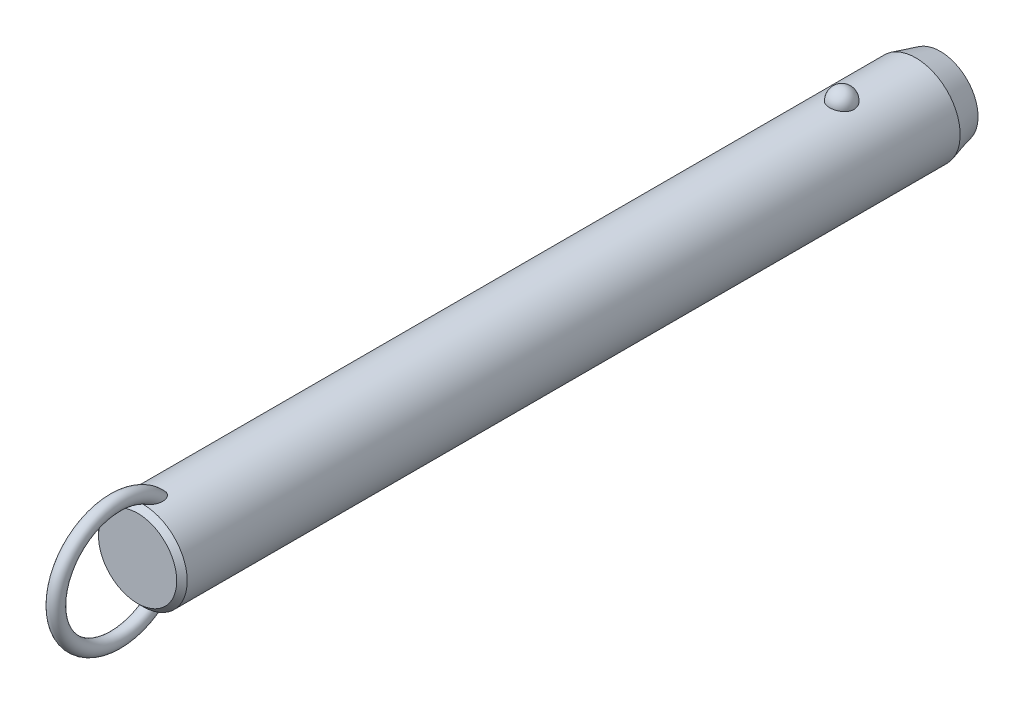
ISO-10303-21;
HEADER;
FILE_DESCRIPTION(('STEP AP214'),'2;1');
FILE_NAME('part.step','',(''),(''),'','','');
FILE_SCHEMA(('AUTOMOTIVE_DESIGN { 1 0 10303 214 1 1 1 1 }'));
ENDSEC;
DATA;
#1=APPLICATION_CONTEXT('core data for automotive mechanical design processes');
#2=APPLICATION_PROTOCOL_DEFINITION('international standard','automotive_design',2000,#1);
#3=PRODUCT_CONTEXT('',#1,'mechanical');
#4=PRODUCT('Part','Part','',(#3));
#5=PRODUCT_RELATED_PRODUCT_CATEGORY('part','',(#4));
#6=PRODUCT_DEFINITION_FORMATION('','',#4);
#7=PRODUCT_DEFINITION_CONTEXT('part definition',#1,'design');
#8=PRODUCT_DEFINITION('design','',#6,#7);
#9=PRODUCT_DEFINITION_SHAPE('','',#8);
#10=(LENGTH_UNIT() NAMED_UNIT(*) SI_UNIT(.MILLI.,.METRE.));
#11=(NAMED_UNIT(*) PLANE_ANGLE_UNIT() SI_UNIT($,.RADIAN.));
#12=(NAMED_UNIT(*) SI_UNIT($,.STERADIAN.) SOLID_ANGLE_UNIT());
#13=UNCERTAINTY_MEASURE_WITH_UNIT(LENGTH_MEASURE(1.E-05),#10,'distance_accuracy_value','');
#14=(GEOMETRIC_REPRESENTATION_CONTEXT(3) GLOBAL_UNCERTAINTY_ASSIGNED_CONTEXT((#13)) GLOBAL_UNIT_ASSIGNED_CONTEXT((#10,
#11,#12)) REPRESENTATION_CONTEXT('',''));
#15=CARTESIAN_POINT('',(0.,0.,0.));
#16=DIRECTION('',(0.,0.,1.));
#17=DIRECTION('',(1.,0.,0.));
#18=AXIS2_PLACEMENT_3D('',#15,#16,#17);
#19=CARTESIAN_POINT('',(0.,0.,185.4));
#20=DIRECTION('',(0.,0.,-1.));
#21=DIRECTION('',(-1.,0.,0.));
#22=AXIS2_PLACEMENT_3D('',#19,#20,#21);
#23=CYLINDRICAL_SURFACE('',#22,12.7);
#24=CARTESIAN_POINT('',(3.46661256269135,12.2177165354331,-3.50000000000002));
#25=CARTESIAN_POINT('',(3.4666090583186,12.2177194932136,-3.30432790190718));
#26=CARTESIAN_POINT('',(3.45063567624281,12.2222841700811,-3.10861112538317));
#27=CARTESIAN_POINT('',(3.38712451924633,12.2400345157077,-2.72271899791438));
#28=CARTESIAN_POINT('',(3.33957415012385,12.2532236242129,-2.53254588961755));
#29=CARTESIAN_POINT('',(3.2141234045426,12.286724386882,-2.16324948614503));
#30=CARTESIAN_POINT('',(3.13623639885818,12.3070329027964,-1.98412136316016));
#31=CARTESIAN_POINT('',(2.95205930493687,12.3525018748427,-1.6418059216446));
#32=CARTESIAN_POINT('',(2.84577003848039,12.3776621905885,-1.47861814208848));
#33=CARTESIAN_POINT('',(2.60688050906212,12.4301712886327,-1.17190583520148));
#34=CARTESIAN_POINT('',(2.47415697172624,12.4575299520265,-1.0284789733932));
#35=CARTESIAN_POINT('',(2.18615174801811,12.5112810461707,-0.766177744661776));
#36=CARTESIAN_POINT('',(2.03087002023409,12.5376734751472,-0.647303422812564));
#37=CARTESIAN_POINT('',(1.70237334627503,12.5864761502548,-0.437732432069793));
#38=CARTESIAN_POINT('',(1.52920948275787,12.6088972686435,-0.346958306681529));
#39=CARTESIAN_POINT('',(1.16944170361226,12.6473352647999,-0.195750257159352));
#40=CARTESIAN_POINT('',(0.982839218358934,12.663352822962,-0.135313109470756));
#41=CARTESIAN_POINT('',(0.604961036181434,12.6869706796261,-0.0473241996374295));
#42=CARTESIAN_POINT('',(0.41382314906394,12.6947125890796,-0.0192185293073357));
#43=CARTESIAN_POINT('',(0.0293827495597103,12.7014203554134,0.00517254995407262));
#44=CARTESIAN_POINT('',(-0.163919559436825,12.7003870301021,0.00146092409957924));
#45=CARTESIAN_POINT('',(-0.544374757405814,12.689735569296,-0.0373939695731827));
#46=CARTESIAN_POINT('',(-0.731575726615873,12.6802364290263,-0.0721015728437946));
#47=CARTESIAN_POINT('',(-1.09733277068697,12.6538333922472,-0.171364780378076));
#48=CARTESIAN_POINT('',(-1.27588869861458,12.6369293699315,-0.235920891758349));
#49=CARTESIAN_POINT('',(-1.6204698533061,12.5973946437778,-0.393548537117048));
#50=CARTESIAN_POINT('',(-1.78641865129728,12.5747321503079,-0.486778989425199));
#51=CARTESIAN_POINT('',(-2.10030671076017,12.5261316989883,-0.699110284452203));
#52=CARTESIAN_POINT('',(-2.24824419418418,12.5001934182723,-0.818213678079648));
#53=CARTESIAN_POINT('',(-2.52491489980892,12.4472906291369,-1.0815712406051));
#54=CARTESIAN_POINT('',(-2.65324222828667,12.4203160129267,-1.22624992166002));
#55=CARTESIAN_POINT('',(-2.88410007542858,12.3687509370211,-1.53528325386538));
#56=CARTESIAN_POINT('',(-2.98662883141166,12.3441606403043,-1.69963924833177));
#57=CARTESIAN_POINT('',(-3.16432417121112,12.2998199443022,-2.04548497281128));
#58=CARTESIAN_POINT('',(-3.23917525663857,12.2801261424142,-2.22714424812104));
#59=CARTESIAN_POINT('',(-3.35800573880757,12.248167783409,-2.60091389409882));
#60=CARTESIAN_POINT('',(-3.4019860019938,12.2359030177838,-2.79302397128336));
#61=CARTESIAN_POINT('',(-3.45784812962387,12.2202347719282,-3.18140279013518));
#62=CARTESIAN_POINT('',(-3.46986123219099,12.2167950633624,-3.37765118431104));
#63=CARTESIAN_POINT('',(-3.46186273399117,12.2190638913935,-3.76943689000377));
#64=CARTESIAN_POINT('',(-3.44185196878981,12.2247721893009,-3.96497421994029));
#65=CARTESIAN_POINT('',(-3.37048652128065,12.2446381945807,-4.34881728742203));
#66=CARTESIAN_POINT('',(-3.31928253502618,12.2587552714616,-4.53715319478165));
#67=CARTESIAN_POINT('',(-3.18693461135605,12.2938237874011,-4.9023172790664));
#68=CARTESIAN_POINT('',(-3.1057895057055,12.3147754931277,-5.07914500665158));
#69=CARTESIAN_POINT('',(-2.91506431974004,12.3613125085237,-5.41732059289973));
#70=CARTESIAN_POINT('',(-2.80533587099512,12.3869217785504,-5.57858147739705));
#71=CARTESIAN_POINT('',(-2.560414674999,12.4398525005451,-5.88013283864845));
#72=CARTESIAN_POINT('',(-2.42522099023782,12.4671740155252,-6.02042254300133));
#73=CARTESIAN_POINT('',(-2.1323357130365,12.5205965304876,-6.27662798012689));
#74=CARTESIAN_POINT('',(-1.97456596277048,12.5466928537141,-6.39245542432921));
#75=CARTESIAN_POINT('',(-1.64115839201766,12.5946384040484,-6.59583547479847));
#76=CARTESIAN_POINT('',(-1.46552179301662,12.6164879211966,-6.68339001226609));
#77=CARTESIAN_POINT('',(-1.10356050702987,12.6532533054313,-6.82682153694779));
#78=CARTESIAN_POINT('',(-0.9173913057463,12.6682500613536,-6.88306988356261));
#79=CARTESIAN_POINT('',(-0.537836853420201,12.6900288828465,-6.96386887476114));
#80=CARTESIAN_POINT('',(-0.344452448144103,12.6968119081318,-6.98842322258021));
#81=CARTESIAN_POINT('',(0.0402577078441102,12.7013667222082,-7.00496469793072));
#82=CARTESIAN_POINT('',(0.231556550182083,12.6993008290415,-6.99753844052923));
#83=CARTESIAN_POINT('',(0.610105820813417,12.6867505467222,-6.95166366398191));
#84=CARTESIAN_POINT('',(0.797356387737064,12.6762664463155,-6.91321620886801));
#85=CARTESIAN_POINT('',(1.16186657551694,12.6480587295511,-6.80658431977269));
#86=CARTESIAN_POINT('',(1.33915951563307,12.6303611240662,-6.73850666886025));
#87=CARTESIAN_POINT('',(1.67968518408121,12.5896027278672,-6.57450875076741));
#88=CARTESIAN_POINT('',(1.84291705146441,12.5665416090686,-6.47858678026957));
#89=CARTESIAN_POINT('',(2.15340192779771,12.5171072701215,-6.25982455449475));
#90=CARTESIAN_POINT('',(2.30037831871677,12.4906895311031,-6.13660186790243));
#91=CARTESIAN_POINT('',(2.5717412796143,12.4376567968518,-5.86739587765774));
#92=CARTESIAN_POINT('',(2.69612388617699,12.4110417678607,-5.72140858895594));
#93=CARTESIAN_POINT('',(2.92107785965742,12.360051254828,-5.40794137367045));
#94=CARTESIAN_POINT('',(3.02121329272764,12.3357209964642,-5.24014110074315));
#95=CARTESIAN_POINT('',(3.19236291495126,12.2925446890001,-4.88969865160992));
#96=CARTESIAN_POINT('',(3.26338839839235,12.2736965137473,-4.70706226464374));
#97=CARTESIAN_POINT('',(3.36788038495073,12.245404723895,-4.35469510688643));
#98=CARTESIAN_POINT('',(3.40484026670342,12.2351018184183,-4.18605935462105));
#99=CARTESIAN_POINT('',(3.45420764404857,12.2212564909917,-3.84496058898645));
#100=CARTESIAN_POINT('',(3.46661565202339,12.2177139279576,-3.67249765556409));
#101=CARTESIAN_POINT('',(3.46661256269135,12.2177165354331,-3.50000000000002));
#102=B_SPLINE_CURVE_WITH_KNOTS('',3,(#24,#25,#26,#27,#28,#29,#30,#31,#32,#33,#34,#35,#36,#37,
#38,#39,#40,#41,#42,#43,#44,#45,#46,#47,#48,#49,#50,#51,#52,#53,#54,#55,#56,#57,#58,#59,#60,#61,
#62,#63,#64,#65,#66,#67,#68,#69,#70,#71,#72,#73,#74,#75,#76,#77,#78,#79,#80,#81,#82,#83,#84,#85,
#86,#87,#88,#89,#90,#91,#92,#93,#94,#95,#96,#97,#98,#99,#100,#101),.UNSPECIFIED.,.T.,.F.,(4,2,2,
2,2,2,2,2,2,2,2,2,2,2,2,2,2,2,2,2,2,2,2,2,2,2,2,2,2,2,2,2,2,2,2,2,2,2,4),(0.,0.586396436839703,
1.17302689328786,1.7593990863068,2.34575431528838,2.93491084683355,3.52406845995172,
4.11158733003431,4.69904375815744,5.2762784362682,5.85345931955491,6.42265312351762,
6.99185659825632,7.56427334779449,8.136746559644,8.71981013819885,9.3029135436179,
9.89247258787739,10.4820150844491,11.0691335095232,11.6562366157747,12.2405256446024,
12.8248374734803,13.412244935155,13.9996740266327,14.5891883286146,15.1786623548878,
15.7609861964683,16.3432419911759,16.9148635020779,17.4864654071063,18.0560241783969,
18.6256177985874,19.2037609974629,19.7820055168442,20.3699810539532,20.957728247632,
21.4746855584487,21.9916320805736),.UNSPECIFIED.);
#103=CARTESIAN_POINT('',(3.46661256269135,12.2177165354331,-3.50000000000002));
#104=VERTEX_POINT('',#103);
#105=EDGE_CURVE('E41',#104,#104,#102,.T.);
#106=ORIENTED_EDGE('',*,*,#105,.T.);
#107=EDGE_LOOP('',(#106));
#108=FACE_BOUND('',#107,.T.);
#109=CARTESIAN_POINT('',(0.,0.,196.6));
#110=DIRECTION('',(0.,0.,1.));
#111=DIRECTION('',(1.,0.,0.));
#112=AXIS2_PLACEMENT_3D('',#109,#110,#111);
#113=CIRCLE('',#112,12.7);
#114=CARTESIAN_POINT('',(12.7,0.,196.6));
#115=VERTEX_POINT('',#114);
#116=EDGE_CURVE('E10',#115,#115,#113,.F.);
#117=ORIENTED_EDGE('',*,*,#116,.T.);
#118=EDGE_LOOP('',(#117));
#119=FACE_BOUND('',#118,.T.);
#120=CARTESIAN_POINT('',(-0.548122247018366,-12.6881662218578,190.343218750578));
#121=CARTESIAN_POINT('',(-0.648865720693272,-12.6838128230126,190.377926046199));
#122=CARTESIAN_POINT('',(-0.746398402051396,-12.6783867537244,190.422042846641));
#123=CARTESIAN_POINT('',(-0.932125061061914,-12.666091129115,190.526764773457));
#124=CARTESIAN_POINT('',(-1.02030388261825,-12.6592192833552,190.587396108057));
#125=CARTESIAN_POINT('',(-1.18487740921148,-12.6448747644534,190.721847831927));
#126=CARTESIAN_POINT('',(-1.26134296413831,-12.637406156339,190.795582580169));
#127=CARTESIAN_POINT('',(-1.4023120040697,-12.6225412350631,190.953604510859));
#128=CARTESIAN_POINT('',(-1.466814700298,-12.6151449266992,191.03789238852));
#129=CARTESIAN_POINT('',(-1.60714786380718,-12.5981718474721,191.249657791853));
#130=CARTESIAN_POINT('',(-1.67725126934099,-12.588900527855,191.380962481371));
#131=CARTESIAN_POINT('',(-1.79536591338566,-12.5725964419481,191.653247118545));
#132=CARTESIAN_POINT('',(-1.84333535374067,-12.5655679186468,191.794244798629));
#133=CARTESIAN_POINT('',(-1.93422576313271,-12.5519624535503,192.137645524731));
#134=CARTESIAN_POINT('',(-1.96788773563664,-12.5466298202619,192.342557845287));
#135=CARTESIAN_POINT('',(-1.9941399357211,-12.542463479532,192.651760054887));
#136=CARTESIAN_POINT('',(-1.99883864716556,-12.5417153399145,192.755298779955));
#137=CARTESIAN_POINT('',(-2.00078003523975,-12.5414074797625,192.96245124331));
#138=CARTESIAN_POINT('',(-1.99802449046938,-12.5418474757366,193.066064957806));
#139=CARTESIAN_POINT('',(-1.98336733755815,-12.5441750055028,193.31032076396));
#140=CARTESIAN_POINT('',(-1.96851430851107,-12.5465291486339,193.450780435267));
#141=CARTESIAN_POINT('',(-1.92707089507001,-12.5529612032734,193.729960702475));
#142=CARTESIAN_POINT('',(-1.90047458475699,-12.5570399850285,193.868680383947));
#143=CARTESIAN_POINT('',(-1.8361912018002,-12.5666008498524,194.14341135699));
#144=CARTESIAN_POINT('',(-1.79850828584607,-12.57208240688,194.279423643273));
#145=CARTESIAN_POINT('',(-1.71223796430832,-12.5841228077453,194.547842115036));
#146=CARTESIAN_POINT('',(-1.66365679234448,-12.5906810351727,194.680250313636));
#147=CARTESIAN_POINT('',(-1.5780450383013,-12.6016176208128,194.88548877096));
#148=CARTESIAN_POINT('',(-1.54477252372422,-12.6057501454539,194.959914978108));
#149=CARTESIAN_POINT('',(-1.47424480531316,-12.6141930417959,195.106839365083));
#150=CARTESIAN_POINT('',(-1.436990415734,-12.6185033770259,195.179337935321));
#151=CARTESIAN_POINT('',(-1.35825795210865,-12.6272207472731,195.321892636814));
#152=CARTESIAN_POINT('',(-1.31678520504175,-12.6316276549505,195.391951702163));
#153=CARTESIAN_POINT('',(-1.22917793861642,-12.6404532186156,195.529070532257));
#154=CARTESIAN_POINT('',(-1.18304514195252,-12.6448718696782,195.596131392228));
#155=CARTESIAN_POINT('',(-1.0724641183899,-12.6547893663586,195.743874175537));
#156=CARTESIAN_POINT('',(-1.00642239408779,-12.6602600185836,195.823384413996));
#157=CARTESIAN_POINT('',(-0.864441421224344,-12.6707460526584,195.973169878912));
#158=CARTESIAN_POINT('',(-0.78851691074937,-12.6757620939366,196.043458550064));
#159=CARTESIAN_POINT('',(-0.65221547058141,-12.6833591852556,196.148680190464));
#160=CARTESIAN_POINT('',(-0.59498203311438,-12.6861973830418,196.187624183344));
#161=CARTESIAN_POINT('',(-0.475269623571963,-12.6912445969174,196.256489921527));
#162=CARTESIAN_POINT('',(-0.412800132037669,-12.6934547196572,196.286427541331));
#163=CARTESIAN_POINT('',(-0.295749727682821,-12.6966636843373,196.329756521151));
#164=CARTESIAN_POINT('',(-0.241949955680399,-12.6978134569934,196.345218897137));
#165=CARTESIAN_POINT('',(-0.132508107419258,-12.6994261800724,196.366884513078));
#166=CARTESIAN_POINT('',(-0.0768679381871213,-12.6998898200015,196.373097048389));
#167=CARTESIAN_POINT('',(0.0347696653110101,-12.7000752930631,196.375583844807));
#168=CARTESIAN_POINT('',(0.0907676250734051,-12.6997954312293,196.371835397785));
#169=CARTESIAN_POINT('',(0.201283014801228,-12.6985255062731,196.354788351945));
#170=CARTESIAN_POINT('',(0.255799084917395,-12.6975348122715,196.341481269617));
#171=CARTESIAN_POINT('',(0.376042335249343,-12.6946091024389,196.30203792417));
#172=CARTESIAN_POINT('',(0.440950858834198,-12.6924943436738,196.273449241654));
#173=CARTESIAN_POINT('',(0.565350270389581,-12.6875639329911,196.206323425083));
#174=CARTESIAN_POINT('',(0.624828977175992,-12.6847467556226,196.167764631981));
#175=CARTESIAN_POINT('',(0.774116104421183,-12.6767252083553,196.056949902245));
#176=CARTESIAN_POINT('',(0.859449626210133,-12.6711344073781,195.978760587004));
#177=CARTESIAN_POINT('',(1.01789440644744,-12.6593922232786,195.810943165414));
#178=CARTESIAN_POINT('',(1.09096902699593,-12.653239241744,195.721282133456));
#179=CARTESIAN_POINT('',(1.22268793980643,-12.6411674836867,195.540265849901));
#180=CARTESIAN_POINT('',(1.28193986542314,-12.6352572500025,195.449345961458));
#181=CARTESIAN_POINT('',(1.39259777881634,-12.6235401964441,195.262792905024));
#182=CARTESIAN_POINT('',(1.44399707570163,-12.6177334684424,195.167155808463));
#183=CARTESIAN_POINT('',(1.53972870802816,-12.6064093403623,194.972273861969));
#184=CARTESIAN_POINT('',(1.58405262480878,-12.6008922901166,194.873024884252));
#185=CARTESIAN_POINT('',(1.66600705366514,-12.5903187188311,194.671772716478));
#186=CARTESIAN_POINT('',(1.70363651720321,-12.5852622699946,194.569769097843));
#187=CARTESIAN_POINT('',(1.77545379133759,-12.5753406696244,194.354358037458));
#188=CARTESIAN_POINT('',(1.80903453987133,-12.5705328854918,194.240745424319));
#189=CARTESIAN_POINT('',(1.86844163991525,-12.5618400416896,194.011457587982));
#190=CARTESIAN_POINT('',(1.89426665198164,-12.5579551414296,193.895782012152));
#191=CARTESIAN_POINT('',(1.9378546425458,-12.5513030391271,193.663007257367));
#192=CARTESIAN_POINT('',(1.9556264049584,-12.5485346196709,193.545909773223));
#193=CARTESIAN_POINT('',(1.98264463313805,-12.5442934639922,193.310747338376));
#194=CARTESIAN_POINT('',(1.99189298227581,-12.5428204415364,193.19268260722));
#195=CARTESIAN_POINT('',(2.00416068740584,-12.540871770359,192.880622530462));
#196=CARTESIAN_POINT('',(1.99944433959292,-12.541631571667,192.686229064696));
#197=CARTESIAN_POINT('',(1.96113755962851,-12.5476846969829,192.300309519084));
#198=CARTESIAN_POINT('',(1.92758341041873,-12.5529723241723,192.108780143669));
#199=CARTESIAN_POINT('',(1.83934342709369,-12.5661532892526,191.782272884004));
#200=CARTESIAN_POINT('',(1.79215440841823,-12.5730485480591,191.64524997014));
#201=CARTESIAN_POINT('',(1.67676242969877,-12.588958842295,191.380445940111));
#202=CARTESIAN_POINT('',(1.60859050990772,-12.597970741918,191.252651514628));
#203=CARTESIAN_POINT('',(1.46583832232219,-12.6152829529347,191.035800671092));
#204=CARTESIAN_POINT('',(1.39525727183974,-12.6233659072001,190.94410500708));
#205=CARTESIAN_POINT('',(1.23992594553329,-12.6395676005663,190.773485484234));
#206=CARTESIAN_POINT('',(1.15517932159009,-12.6476863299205,190.694558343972));
#207=CARTESIAN_POINT('',(0.971995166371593,-12.6630846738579,190.552643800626));
#208=CARTESIAN_POINT('',(0.873456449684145,-12.6703572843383,190.489784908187));
#209=CARTESIAN_POINT('',(0.665847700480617,-12.6829569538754,190.384487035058));
#210=CARTESIAN_POINT('',(0.556784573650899,-12.688285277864,190.342034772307));
#211=CARTESIAN_POINT('',(0.347338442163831,-12.6956226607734,190.284443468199));
#212=CARTESIAN_POINT('',(0.247759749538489,-12.6979816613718,190.266399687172));
#213=CARTESIAN_POINT('',(0.0470218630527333,-12.7003077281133,190.248600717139));
#214=CARTESIAN_POINT('',(-0.0541350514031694,-12.7002779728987,190.248821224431));
#215=CARTESIAN_POINT('',(-0.221414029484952,-12.6982482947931,190.264363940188));
#216=CARTESIAN_POINT('',(-0.288055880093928,-12.6969033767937,190.274666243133));
#217=CARTESIAN_POINT('',(-0.419599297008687,-12.6932369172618,190.30313489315));
#218=CARTESIAN_POINT('',(-0.484501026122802,-12.6909154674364,190.321300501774));
#219=CARTESIAN_POINT('',(-0.548122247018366,-12.6881662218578,190.343218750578));
#220=B_SPLINE_CURVE_WITH_KNOTS('',3,(#120,#121,#122,#123,#124,#125,#126,#127,#128,#129,#130,
#131,#132,#133,#134,#135,#136,#137,#138,#139,#140,#141,#142,#143,#144,#145,#146,#147,#148,#149,
#150,#151,#152,#153,#154,#155,#156,#157,#158,#159,#160,#161,#162,#163,#164,#165,#166,#167,#168,
#169,#170,#171,#172,#173,#174,#175,#176,#177,#178,#179,#180,#181,#182,#183,#184,#185,#186,#187,
#188,#189,#190,#191,#192,#193,#194,#195,#196,#197,#198,#199,#200,#201,#202,#203,#204,#205,#206,
#207,#208,#209,#210,#211,#212,#213,#214,#215,#216,#217,#218,#219),.UNSPECIFIED.,.T.,.F.,(4,2,2,
2,2,2,2,2,2,2,2,2,2,2,2,2,2,2,2,2,2,2,2,2,2,2,2,2,2,2,2,2,2,2,2,2,2,2,2,2,2,2,2,2,2,2,2,2,2,4),
(0.,0.31964225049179,0.639794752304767,0.957927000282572,1.27608021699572,1.72100165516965,
2.16675988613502,2.78630021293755,3.09705782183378,3.40774128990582,3.83096358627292,
4.25439969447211,4.67767724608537,5.10071330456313,5.34550297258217,5.59024267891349,
5.83467707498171,6.07902143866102,6.38891080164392,6.69834321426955,6.9056091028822,
7.11250749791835,7.27977315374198,7.44687060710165,7.61434932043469,7.78197685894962,
7.99365544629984,8.20579780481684,8.55147335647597,8.89816429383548,9.22375138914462,
9.54961437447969,9.87586224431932,10.202161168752,10.557587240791,10.9130746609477,
11.2681734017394,11.6231936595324,12.2046601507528,12.7853961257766,13.219164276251,
13.6522938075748,13.9989174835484,14.3454519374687,14.6946768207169,15.0436740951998,
15.3457513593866,15.6474266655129,15.8493051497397,16.0511646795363),.UNSPECIFIED.);
#221=CARTESIAN_POINT('',(-0.548122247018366,-12.6881662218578,190.343218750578));
#222=VERTEX_POINT('',#221);
#223=EDGE_CURVE('E60',#222,#222,#220,.T.);
#224=ORIENTED_EDGE('',*,*,#223,.T.);
#225=EDGE_LOOP('',(#224));
#226=FACE_BOUND('',#225,.T.);
#227=CARTESIAN_POINT('',(-0.548122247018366,12.6881662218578,190.343218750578));
#228=CARTESIAN_POINT('',(-0.459436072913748,12.6919968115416,190.312673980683));
#229=CARTESIAN_POINT('',(-0.368189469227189,12.6949996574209,190.289391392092));
#230=CARTESIAN_POINT('',(-0.183024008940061,12.6990186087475,190.258406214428));
#231=CARTESIAN_POINT('',(-0.0891049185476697,12.7000345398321,190.250704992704));
#232=CARTESIAN_POINT('',(0.0987147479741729,12.6999636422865,190.251245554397));
#233=CARTESIAN_POINT('',(0.192615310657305,12.6988761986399,190.259492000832));
#234=CARTESIAN_POINT('',(0.377658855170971,12.6947211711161,190.291551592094));
#235=CARTESIAN_POINT('',(0.468801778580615,12.6916535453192,190.315365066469));
#236=CARTESIAN_POINT('',(0.645809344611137,12.6838788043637,190.37745651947));
#237=CARTESIAN_POINT('',(0.731679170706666,12.6791733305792,190.415720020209));
#238=CARTESIAN_POINT('',(0.896315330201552,12.6686004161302,190.505120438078));
#239=CARTESIAN_POINT('',(0.975080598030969,12.6627328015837,190.556259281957));
#240=CARTESIAN_POINT('',(1.12963655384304,12.6499161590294,190.67367820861));
#241=CARTESIAN_POINT('',(1.20478673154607,12.6429194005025,190.740792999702));
#242=CARTESIAN_POINT('',(1.34448241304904,12.6288282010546,190.88522507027));
#243=CARTESIAN_POINT('',(1.40902173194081,12.621733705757,190.962548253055));
#244=CARTESIAN_POINT('',(1.55208211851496,12.6050877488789,191.159247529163));
#245=CARTESIAN_POINT('',(1.62510490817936,12.5957546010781,191.282654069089));
#246=CARTESIAN_POINT('',(1.75019044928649,12.5789823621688,191.539769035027));
#247=CARTESIAN_POINT('',(1.8022137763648,12.5715468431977,191.673496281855));
#248=CARTESIAN_POINT('',(1.90309965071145,12.5567434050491,191.998351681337));
#249=CARTESIAN_POINT('',(1.94342317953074,12.5504515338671,192.192161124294));
#250=CARTESIAN_POINT('',(1.99332997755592,12.5426147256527,192.58378810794));
#251=CARTESIAN_POINT('',(2.00285305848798,12.5410790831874,192.781612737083));
#252=CARTESIAN_POINT('',(1.99678999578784,12.5420407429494,193.116642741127));
#253=CARTESIAN_POINT('',(1.98794117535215,12.5434564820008,193.254042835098));
#254=CARTESIAN_POINT('',(1.95865119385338,12.5480641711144,193.527639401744));
#255=CARTESIAN_POINT('',(1.93820436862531,12.5512569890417,193.663835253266));
#256=CARTESIAN_POINT('',(1.886478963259,12.5591352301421,193.934249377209));
#257=CARTESIAN_POINT('',(1.85518800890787,12.5638223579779,194.068465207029));
#258=CARTESIAN_POINT('',(1.782178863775,12.5743868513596,194.333936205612));
#259=CARTESIAN_POINT('',(1.74046509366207,12.5802637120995,194.465192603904));
#260=CARTESIAN_POINT('',(1.66024095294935,12.5910571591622,194.686085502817));
#261=CARTESIAN_POINT('',(1.62434772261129,12.5957535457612,194.776690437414));
#262=CARTESIAN_POINT('',(1.54709009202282,12.6054762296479,194.955512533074));
#263=CARTESIAN_POINT('',(1.50572681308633,12.6105024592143,195.043730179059));
#264=CARTESIAN_POINT('',(1.41728020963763,12.620748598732,195.216932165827));
#265=CARTESIAN_POINT('',(1.37021377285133,12.625967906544,195.301925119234));
#266=CARTESIAN_POINT('',(1.26969620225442,12.6364721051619,195.468007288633));
#267=CARTESIAN_POINT('',(1.21624929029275,12.6417569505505,195.549099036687));
#268=CARTESIAN_POINT('',(1.10304413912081,12.6521331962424,195.704702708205));
#269=CARTESIAN_POINT('',(1.04340936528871,12.657226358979,195.779303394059));
#270=CARTESIAN_POINT('',(0.915919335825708,12.667090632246,195.921324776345));
#271=CARTESIAN_POINT('',(0.84806456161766,12.6718617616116,195.98874589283));
#272=CARTESIAN_POINT('',(0.717035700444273,12.67987711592,196.100624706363));
#273=CARTESIAN_POINT('',(0.655526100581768,12.6832377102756,196.146997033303));
#274=CARTESIAN_POINT('',(0.525985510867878,12.6892676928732,196.229619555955));
#275=CARTESIAN_POINT('',(0.457969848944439,12.6919386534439,196.265892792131));
#276=CARTESIAN_POINT('',(0.334859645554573,12.695691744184,196.316657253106));
#277=CARTESIAN_POINT('',(0.281116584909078,12.6970073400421,196.334373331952));
#278=CARTESIAN_POINT('',(0.171425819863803,12.6989609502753,196.360642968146));
#279=CARTESIAN_POINT('',(0.115480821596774,12.699599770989,196.369207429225));
#280=CARTESIAN_POINT('',(0.00272618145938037,12.7001251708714,196.376253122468));
#281=CARTESIAN_POINT('',(-0.0540859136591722,12.7000089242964,196.374696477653));
#282=CARTESIAN_POINT('',(-0.16654462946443,12.6990328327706,196.361600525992));
#283=CARTESIAN_POINT('',(-0.222190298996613,12.6981724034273,196.350053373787));
#284=CARTESIAN_POINT('',(-0.342018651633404,12.695562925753,196.314912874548));
#285=CARTESIAN_POINT('',(-0.405606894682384,12.6936676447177,196.28933225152));
#286=CARTESIAN_POINT('',(-0.527815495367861,12.6891754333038,196.228311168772));
#287=CARTESIAN_POINT('',(-0.586425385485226,12.6865770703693,196.192850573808));
#288=CARTESIAN_POINT('',(-0.731842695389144,12.6792129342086,196.091496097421));
#289=CARTESIAN_POINT('',(-0.81470941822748,12.6740767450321,196.0200395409));
#290=CARTESIAN_POINT('',(-0.969101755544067,12.6632083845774,195.86589007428));
#291=CARTESIAN_POINT('',(-1.04059564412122,12.6574746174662,195.783166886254));
#292=CARTESIAN_POINT('',(-1.16981116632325,12.6461638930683,195.615809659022));
#293=CARTESIAN_POINT('',(-1.22811369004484,12.6405994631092,195.531616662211));
#294=CARTESIAN_POINT('',(-1.33743405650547,12.6295007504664,195.358579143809));
#295=CARTESIAN_POINT('',(-1.38844577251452,12.6239664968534,195.269730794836));
#296=CARTESIAN_POINT('',(-1.48400702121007,12.6130898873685,195.088389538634));
#297=CARTESIAN_POINT('',(-1.52854232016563,12.6077479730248,194.995889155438));
#298=CARTESIAN_POINT('',(-1.61150113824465,12.5974127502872,194.808160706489));
#299=CARTESIAN_POINT('',(-1.64992317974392,12.5924195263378,194.712931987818));
#300=CARTESIAN_POINT('',(-1.73468589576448,12.581070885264,194.48289362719));
#301=CARTESIAN_POINT('',(-1.77831261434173,12.5749388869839,194.347066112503));
#302=CARTESIAN_POINT('',(-1.85439734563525,12.5639437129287,194.072212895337));
#303=CARTESIAN_POINT('',(-1.88684994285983,12.5590811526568,193.933185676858));
#304=CARTESIAN_POINT('',(-1.94008483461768,12.550968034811,193.65309235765));
#305=CARTESIAN_POINT('',(-1.96088706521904,12.5477147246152,193.512030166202));
#306=CARTESIAN_POINT('',(-1.99000539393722,12.5431291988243,193.228668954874));
#307=CARTESIAN_POINT('',(-1.99832911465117,12.5417958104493,193.086370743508));
#308=CARTESIAN_POINT('',(-2.00166624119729,12.5412674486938,192.757627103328));
#309=CARTESIAN_POINT('',(-1.99178843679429,12.5428579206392,192.571088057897));
#310=CARTESIAN_POINT('',(-1.94455183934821,12.5502731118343,192.20162404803));
#311=CARTESIAN_POINT('',(-1.90724032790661,12.5560905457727,192.018693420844));
#312=CARTESIAN_POINT('',(-1.81330718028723,12.5699462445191,191.704848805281));
#313=CARTESIAN_POINT('',(-1.76338820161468,12.5771273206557,191.571910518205));
#314=CARTESIAN_POINT('',(-1.64305018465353,12.593414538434,191.315681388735));
#315=CARTESIAN_POINT('',(-1.57265346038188,12.6025185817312,191.192380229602));
#316=CARTESIAN_POINT('',(-1.42634956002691,12.6198178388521,190.983564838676));
#317=CARTESIAN_POINT('',(-1.35423772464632,12.6278405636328,190.895384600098));
#318=CARTESIAN_POINT('',(-1.19645664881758,12.6437632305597,190.732107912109));
#319=CARTESIAN_POINT('',(-1.1108053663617,12.6516633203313,190.656994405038));
#320=CARTESIAN_POINT('',(-0.947219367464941,12.6648319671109,190.537811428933));
#321=CARTESIAN_POINT('',(-0.871624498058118,12.670300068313,190.490541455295));
#322=CARTESIAN_POINT('',(-0.714161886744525,12.6801492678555,190.4077413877));
#323=CARTESIAN_POINT('',(-0.632295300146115,12.684530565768,190.37220913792));
#324=CARTESIAN_POINT('',(-0.548122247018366,12.6881662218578,190.343218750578));
#325=B_SPLINE_CURVE_WITH_KNOTS('',3,(#227,#228,#229,#230,#231,#232,#233,#234,#235,#236,#237,
#238,#239,#240,#241,#242,#243,#244,#245,#246,#247,#248,#249,#250,#251,#252,#253,#254,#255,#256,
#257,#258,#259,#260,#261,#262,#263,#264,#265,#266,#267,#268,#269,#270,#271,#272,#273,#274,#275,
#276,#277,#278,#279,#280,#281,#282,#283,#284,#285,#286,#287,#288,#289,#290,#291,#292,#293,#294,
#295,#296,#297,#298,#299,#300,#301,#302,#303,#304,#305,#306,#307,#308,#309,#310,#311,#312,#313,
#314,#315,#316,#317,#318,#319,#320,#321,#322,#323,#324),.UNSPECIFIED.,.T.,.F.,(4,2,2,2,2,2,2,2,
2,2,2,2,2,2,2,2,2,2,2,2,2,2,2,2,2,2,2,2,2,2,2,2,2,2,2,2,2,2,2,2,2,2,2,2,2,2,2,2,4),(0.,
0.281328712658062,0.562682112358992,0.844117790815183,1.12555942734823,1.40671982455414,
1.68792232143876,1.98972294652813,2.29169886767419,2.72039860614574,3.14989948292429,
3.74084916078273,4.33295293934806,4.74554109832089,5.15833092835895,5.57159335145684,
5.98468079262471,6.27722775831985,6.56971484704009,6.86135609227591,7.15280542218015,
7.43927407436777,7.72572595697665,7.95635862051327,8.18646071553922,8.35559393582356,
8.52452541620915,8.69408946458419,8.86378678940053,9.06834348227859,9.27332014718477,
9.60010414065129,9.92778432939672,10.2350252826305,10.5425229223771,10.8506864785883,
11.15892440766,11.5867893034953,12.0148612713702,12.4421984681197,12.8692745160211,
13.4279365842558,13.9856380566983,14.4107062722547,14.835313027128,15.1765567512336,
15.517351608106,15.7844129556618,16.051425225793),.UNSPECIFIED.);
#326=CARTESIAN_POINT('',(-0.548122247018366,12.6881662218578,190.343218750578));
#327=VERTEX_POINT('',#326);
#328=EDGE_CURVE('E68',#327,#327,#325,.T.);
#329=ORIENTED_EDGE('',*,*,#328,.T.);
#330=EDGE_LOOP('',(#329));
#331=FACE_BOUND('',#330,.T.);
#332=CARTESIAN_POINT('',(0.,0.,-24.6999999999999));
#333=DIRECTION('',(0.,0.,-1.));
#334=DIRECTION('',(-1.,0.,0.));
#335=AXIS2_PLACEMENT_3D('',#332,#333,#334);
#336=CIRCLE('',#335,12.7);
#337=CARTESIAN_POINT('',(-12.7,0.,-24.6999999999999));
#338=VERTEX_POINT('',#337);
#339=EDGE_CURVE('E57',#338,#338,#336,.F.);
#340=ORIENTED_EDGE('',*,*,#339,.T.);
#341=EDGE_LOOP('',(#340));
#342=FACE_BOUND('',#341,.T.);
#343=ADVANCED_FACE('F37',(#108,#119,#226,#331,#342),#23,.T.);
#344=CARTESIAN_POINT('',(0.,0.,-31.7));
#345=DIRECTION('',(0.,0.,-1.));
#346=DIRECTION('',(-1.,0.,0.));
#347=AXIS2_PLACEMENT_3D('',#344,#345,#346);
#348=PLANE('',#347);
#349=CARTESIAN_POINT('',(0.,0.,-31.7));
#350=DIRECTION('',(0.,0.,-1.));
#351=DIRECTION('',(-1.,0.,0.));
#352=AXIS2_PLACEMENT_3D('',#349,#350,#351);
#353=CIRCLE('',#352,10.8243556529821);
#354=CARTESIAN_POINT('',(-10.8243556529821,0.,-31.7));
#355=VERTEX_POINT('',#354);
#356=EDGE_CURVE('E67',#355,#355,#353,.T.);
#357=ORIENTED_EDGE('',*,*,#356,.T.);
#358=EDGE_LOOP('',(#357));
#359=FACE_BOUND('',#358,.T.);
#360=ADVANCED_FACE('F86',(#359),#348,.T.);
#361=CARTESIAN_POINT('',(0.,0.,-31.7));
#362=DIRECTION('',(0.,0.,1.));
#363=DIRECTION('',(1.,0.,0.));
#364=AXIS2_PLACEMENT_3D('',#361,#362,#363);
#365=CONICAL_SURFACE('',#364,10.8243556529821,0.261799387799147);
#366=ORIENTED_EDGE('',*,*,#339,.F.);
#367=EDGE_LOOP('',(#366));
#368=FACE_BOUND('',#367,.T.);
#369=ORIENTED_EDGE('',*,*,#356,.F.);
#370=EDGE_LOOP('',(#369));
#371=FACE_BOUND('',#370,.T.);
#372=ADVANCED_FACE('F84',(#368,#371),#365,.T.);
#373=CARTESIAN_POINT('',(0.,0.,198.1));
#374=DIRECTION('',(0.,0.,1.));
#375=DIRECTION('',(1.,0.,0.));
#376=AXIS2_PLACEMENT_3D('',#373,#374,#375);
#377=PLANE('',#376);
#378=CARTESIAN_POINT('',(0.,0.,198.1));
#379=DIRECTION('',(0.,0.,1.));
#380=DIRECTION('',(1.,0.,0.));
#381=AXIS2_PLACEMENT_3D('',#378,#379,#380);
#382=CIRCLE('',#381,11.2);
#383=CARTESIAN_POINT('',(11.2,0.,198.1));
#384=VERTEX_POINT('',#383);
#385=EDGE_CURVE('E50',#384,#384,#382,.T.);
#386=ORIENTED_EDGE('',*,*,#385,.T.);
#387=EDGE_LOOP('',(#386));
#388=FACE_BOUND('',#387,.T.);
#389=ADVANCED_FACE('F78',(#388),#377,.T.);
#390=CARTESIAN_POINT('',(0.,0.,204.45));
#391=DIRECTION('',(1.,0.,0.));
#392=DIRECTION('',(0.,0.,-1.));
#393=AXIS2_PLACEMENT_3D('',#390,#391,#392);
#394=TOROIDAL_SURFACE('',#393,17.05,2.);
#395=ORIENTED_EDGE('',*,*,#328,.F.);
#396=EDGE_LOOP('',(#395));
#397=FACE_BOUND('',#396,.T.);
#398=ORIENTED_EDGE('',*,*,#223,.F.);
#399=EDGE_LOOP('',(#398));
#400=FACE_BOUND('',#399,.T.);
#401=ADVANCED_FACE('F74',(#397,#400),#394,.T.);
#402=CARTESIAN_POINT('',(0.,0.,198.1));
#403=DIRECTION('',(0.,0.,-1.));
#404=DIRECTION('',(-1.,0.,0.));
#405=AXIS2_PLACEMENT_3D('',#402,#403,#404);
#406=CONICAL_SURFACE('',#405,11.2,0.785398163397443);
#407=ORIENTED_EDGE('',*,*,#116,.F.);
#408=EDGE_LOOP('',(#407));
#409=FACE_BOUND('',#408,.T.);
#410=ORIENTED_EDGE('',*,*,#385,.F.);
#411=EDGE_LOOP('',(#410));
#412=FACE_BOUND('',#411,.T.);
#413=ADVANCED_FACE('F39',(#409,#412),#406,.T.);
#414=CARTESIAN_POINT('',(0.,12.7,-3.50000000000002));
#415=DIRECTION('',(0.,1.,0.));
#416=DIRECTION('',(0.,0.,-1.));
#417=AXIS2_PLACEMENT_3D('',#414,#415,#416);
#418=SPHERICAL_SURFACE('',#417,3.5);
#419=ORIENTED_EDGE('',*,*,#105,.F.);
#420=EDGE_LOOP('',(#419));
#421=FACE_BOUND('',#420,.T.);
#422=ADVANCED_FACE('F80',(#421),#418,.T.);
#423=CLOSED_SHELL('',(#343,#360,#372,#389,#401,#413,#422));
#424=MANIFOLD_SOLID_BREP('B2',#423);
#425=ADVANCED_BREP_SHAPE_REPRESENTATION('',(#18,#424),#14);
#426=SHAPE_DEFINITION_REPRESENTATION(#9,#425);
ENDSEC;
END-ISO-10303-21;
